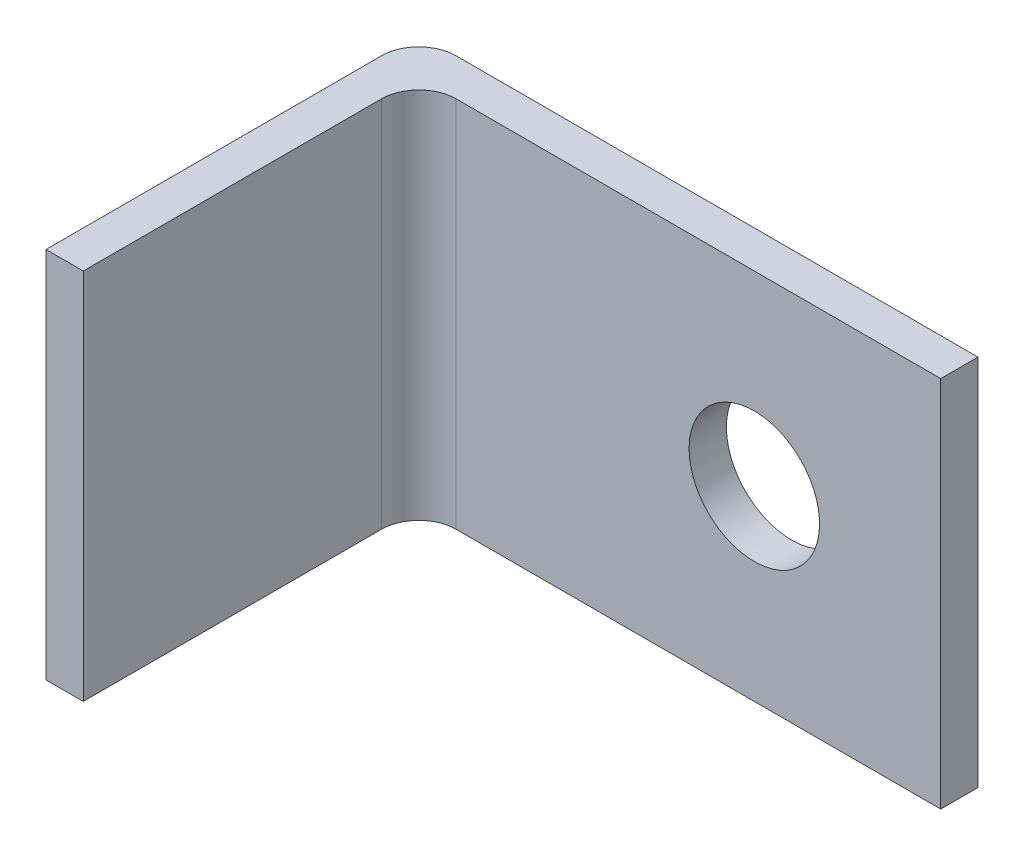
ISO-10303-21;
HEADER;
FILE_DESCRIPTION(('STEP AP214'),'2;1');
FILE_NAME('part.step','',(''),(''),'','','');
FILE_SCHEMA(('AUTOMOTIVE_DESIGN { 1 0 10303 214 1 1 1 1 }'));
ENDSEC;
DATA;
#1=APPLICATION_CONTEXT('core data for automotive mechanical design processes');
#2=APPLICATION_PROTOCOL_DEFINITION('international standard','automotive_design',2000,#1);
#3=PRODUCT_CONTEXT('',#1,'mechanical');
#4=PRODUCT('Part','Part','',(#3));
#5=PRODUCT_RELATED_PRODUCT_CATEGORY('part','',(#4));
#6=PRODUCT_DEFINITION_FORMATION('','',#4);
#7=PRODUCT_DEFINITION_CONTEXT('part definition',#1,'design');
#8=PRODUCT_DEFINITION('design','',#6,#7);
#9=PRODUCT_DEFINITION_SHAPE('','',#8);
#10=(LENGTH_UNIT() NAMED_UNIT(*) SI_UNIT(.MILLI.,.METRE.));
#11=(NAMED_UNIT(*) PLANE_ANGLE_UNIT() SI_UNIT($,.RADIAN.));
#12=(NAMED_UNIT(*) SI_UNIT($,.STERADIAN.) SOLID_ANGLE_UNIT());
#13=UNCERTAINTY_MEASURE_WITH_UNIT(LENGTH_MEASURE(1.E-05),#10,'distance_accuracy_value','');
#14=(GEOMETRIC_REPRESENTATION_CONTEXT(3) GLOBAL_UNCERTAINTY_ASSIGNED_CONTEXT((#13)) GLOBAL_UNIT_ASSIGNED_CONTEXT((#10,
#11,#12)) REPRESENTATION_CONTEXT('',''));
#15=CARTESIAN_POINT('',(0.,0.,0.));
#16=DIRECTION('',(0.,0.,1.));
#17=DIRECTION('',(1.,0.,0.));
#18=AXIS2_PLACEMENT_3D('',#15,#16,#17);
#19=CARTESIAN_POINT('',(1.,10.,0.));
#20=DIRECTION('',(0.,0.,-1.));
#21=DIRECTION('',(-1.,0.,0.));
#22=AXIS2_PLACEMENT_3D('',#19,#20,#21);
#23=PLANE('',#22);
#24=DIRECTION('',(1.,0.,0.));
#25=VECTOR('',#24,1.);
#26=CARTESIAN_POINT('',(1.,0.,0.));
#27=LINE('',#26,#25);
#28=CARTESIAN_POINT('',(0.,0.,0.));
#29=VERTEX_POINT('',#28);
#30=CARTESIAN_POINT('',(1.,0.,0.));
#31=VERTEX_POINT('',#30);
#32=EDGE_CURVE('E99',#29,#31,#27,.T.);
#33=ORIENTED_EDGE('',*,*,#32,.T.);
#34=DIRECTION('',(0.,-1.,0.));
#35=VECTOR('',#34,1.);
#36=CARTESIAN_POINT('',(1.,10.,0.));
#37=LINE('',#36,#35);
#38=CARTESIAN_POINT('',(1.,10.,0.));
#39=VERTEX_POINT('',#38);
#40=EDGE_CURVE('E103',#39,#31,#37,.T.);
#41=ORIENTED_EDGE('',*,*,#40,.F.);
#42=DIRECTION('',(1.,0.,0.));
#43=VECTOR('',#42,1.);
#44=CARTESIAN_POINT('',(1.,10.,0.));
#45=LINE('',#44,#43);
#46=CARTESIAN_POINT('',(0.,10.,0.));
#47=VERTEX_POINT('',#46);
#48=EDGE_CURVE('E130',#47,#39,#45,.T.);
#49=ORIENTED_EDGE('',*,*,#48,.F.);
#50=DIRECTION('',(0.,-1.,0.));
#51=VECTOR('',#50,1.);
#52=CARTESIAN_POINT('',(0.,10.,0.));
#53=LINE('',#52,#51);
#54=EDGE_CURVE('E114',#47,#29,#53,.T.);
#55=ORIENTED_EDGE('',*,*,#54,.T.);
#56=EDGE_LOOP('',(#33,#41,#49,#55));
#57=FACE_BOUND('',#56,.T.);
#58=ADVANCED_FACE('F34',(#57),#23,.F.);
#59=CARTESIAN_POINT('',(1.,10.,0.));
#60=DIRECTION('',(-1.,0.,0.));
#61=DIRECTION('',(0.,0.,1.));
#62=AXIS2_PLACEMENT_3D('',#59,#60,#61);
#63=PLANE('',#62);
#64=DIRECTION('',(0.,0.,-1.));
#65=VECTOR('',#64,1.);
#66=CARTESIAN_POINT('',(1.,0.,0.));
#67=LINE('',#66,#65);
#68=CARTESIAN_POINT('',(1.,0.,-8.));
#69=VERTEX_POINT('',#68);
#70=EDGE_CURVE('E94',#31,#69,#67,.T.);
#71=ORIENTED_EDGE('',*,*,#70,.T.);
#72=DIRECTION('',(0.,-1.,0.));
#73=VECTOR('',#72,1.);
#74=CARTESIAN_POINT('',(1.,10.,-8.));
#75=LINE('',#74,#73);
#76=CARTESIAN_POINT('',(1.,10.,-8.));
#77=VERTEX_POINT('',#76);
#78=EDGE_CURVE('E48',#69,#77,#75,.F.);
#79=ORIENTED_EDGE('',*,*,#78,.T.);
#80=DIRECTION('',(0.,0.,-1.));
#81=VECTOR('',#80,1.);
#82=CARTESIAN_POINT('',(1.,10.,0.));
#83=LINE('',#82,#81);
#84=EDGE_CURVE('E105',#39,#77,#83,.T.);
#85=ORIENTED_EDGE('',*,*,#84,.F.);
#86=ORIENTED_EDGE('',*,*,#40,.T.);
#87=EDGE_LOOP('',(#71,#79,#85,#86));
#88=FACE_BOUND('',#87,.T.);
#89=ADVANCED_FACE('F104',(#88),#63,.F.);
#90=CARTESIAN_POINT('',(1.,10.,-9.));
#91=DIRECTION('',(0.,0.,-1.));
#92=DIRECTION('',(-1.,0.,0.));
#93=AXIS2_PLACEMENT_3D('',#90,#91,#92);
#94=PLANE('',#93);
#95=CARTESIAN_POINT('',(10.,5.,-9.));
#96=DIRECTION('',(0.,0.,-1.));
#97=DIRECTION('',(-1.,0.,0.));
#98=AXIS2_PLACEMENT_3D('',#95,#96,#97);
#99=CIRCLE('',#98,1.75);
#100=CARTESIAN_POINT('',(8.25,5.,-9.));
#101=VERTEX_POINT('',#100);
#102=EDGE_CURVE('E115',#101,#101,#99,.T.);
#103=ORIENTED_EDGE('',*,*,#102,.T.);
#104=EDGE_LOOP('',(#103));
#105=FACE_BOUND('',#104,.T.);
#106=DIRECTION('',(1.,0.,0.));
#107=VECTOR('',#106,1.);
#108=CARTESIAN_POINT('',(1.,10.,-9.));
#109=LINE('',#108,#107);
#110=CARTESIAN_POINT('',(2.,10.,-9.));
#111=VERTEX_POINT('',#110);
#112=CARTESIAN_POINT('',(15.,10.,-9.));
#113=VERTEX_POINT('',#112);
#114=EDGE_CURVE('E133',#111,#113,#109,.T.);
#115=ORIENTED_EDGE('',*,*,#114,.F.);
#116=DIRECTION('',(0.,-1.,0.));
#117=VECTOR('',#116,1.);
#118=CARTESIAN_POINT('',(2.,0.,-9.));
#119=LINE('',#118,#117);
#120=CARTESIAN_POINT('',(2.,0.,-9.));
#121=VERTEX_POINT('',#120);
#122=EDGE_CURVE('E156',#111,#121,#119,.T.);
#123=ORIENTED_EDGE('',*,*,#122,.T.);
#124=DIRECTION('',(1.,0.,0.));
#125=VECTOR('',#124,1.);
#126=CARTESIAN_POINT('',(1.,0.,-9.));
#127=LINE('',#126,#125);
#128=CARTESIAN_POINT('',(15.,0.,-9.));
#129=VERTEX_POINT('',#128);
#130=EDGE_CURVE('E100',#121,#129,#127,.T.);
#131=ORIENTED_EDGE('',*,*,#130,.T.);
#132=DIRECTION('',(0.,-1.,0.));
#133=VECTOR('',#132,1.);
#134=CARTESIAN_POINT('',(15.,10.,-9.));
#135=LINE('',#134,#133);
#136=EDGE_CURVE('E110',#113,#129,#135,.T.);
#137=ORIENTED_EDGE('',*,*,#136,.F.);
#138=EDGE_LOOP('',(#115,#123,#131,#137));
#139=FACE_BOUND('',#138,.T.);
#140=ADVANCED_FACE('F162',(#105,#139),#94,.F.);
#141=CARTESIAN_POINT('',(15.,10.,-10.));
#142=DIRECTION('',(-1.,0.,0.));
#143=DIRECTION('',(0.,0.,1.));
#144=AXIS2_PLACEMENT_3D('',#141,#142,#143);
#145=PLANE('',#144);
#146=DIRECTION('',(0.,0.,-1.));
#147=VECTOR('',#146,1.);
#148=CARTESIAN_POINT('',(15.,0.,-10.));
#149=LINE('',#148,#147);
#150=CARTESIAN_POINT('',(15.,0.,-10.));
#151=VERTEX_POINT('',#150);
#152=EDGE_CURVE('E123',#129,#151,#149,.T.);
#153=ORIENTED_EDGE('',*,*,#152,.T.);
#154=DIRECTION('',(0.,-1.,0.));
#155=VECTOR('',#154,1.);
#156=CARTESIAN_POINT('',(15.,10.,-10.));
#157=LINE('',#156,#155);
#158=CARTESIAN_POINT('',(15.,10.,-10.));
#159=VERTEX_POINT('',#158);
#160=EDGE_CURVE('E143',#159,#151,#157,.T.);
#161=ORIENTED_EDGE('',*,*,#160,.F.);
#162=DIRECTION('',(0.,0.,-1.));
#163=VECTOR('',#162,1.);
#164=CARTESIAN_POINT('',(15.,10.,-10.));
#165=LINE('',#164,#163);
#166=EDGE_CURVE('E135',#113,#159,#165,.T.);
#167=ORIENTED_EDGE('',*,*,#166,.F.);
#168=ORIENTED_EDGE('',*,*,#136,.T.);
#169=EDGE_LOOP('',(#153,#161,#167,#168));
#170=FACE_BOUND('',#169,.T.);
#171=ADVANCED_FACE('F170',(#170),#145,.F.);
#172=CARTESIAN_POINT('',(0.,10.,-10.));
#173=DIRECTION('',(0.,0.,1.));
#174=DIRECTION('',(1.,0.,0.));
#175=AXIS2_PLACEMENT_3D('',#172,#173,#174);
#176=PLANE('',#175);
#177=CARTESIAN_POINT('',(10.,5.,-10.));
#178=DIRECTION('',(0.,0.,-1.));
#179=DIRECTION('',(-1.,0.,0.));
#180=AXIS2_PLACEMENT_3D('',#177,#178,#179);
#181=CIRCLE('',#180,1.75);
#182=CARTESIAN_POINT('',(8.25,5.,-10.));
#183=VERTEX_POINT('',#182);
#184=EDGE_CURVE('E118',#183,#183,#181,.T.);
#185=ORIENTED_EDGE('',*,*,#184,.F.);
#186=EDGE_LOOP('',(#185));
#187=FACE_BOUND('',#186,.T.);
#188=DIRECTION('',(-1.,0.,0.));
#189=VECTOR('',#188,1.);
#190=CARTESIAN_POINT('',(0.,0.,-10.));
#191=LINE('',#190,#189);
#192=CARTESIAN_POINT('',(1.,0.,-10.));
#193=VERTEX_POINT('',#192);
#194=EDGE_CURVE('E125',#151,#193,#191,.T.);
#195=ORIENTED_EDGE('',*,*,#194,.T.);
#196=DIRECTION('',(0.,-1.,0.));
#197=VECTOR('',#196,1.);
#198=CARTESIAN_POINT('',(1.,10.,-10.));
#199=LINE('',#198,#197);
#200=CARTESIAN_POINT('',(1.,10.,-10.));
#201=VERTEX_POINT('',#200);
#202=EDGE_CURVE('E152',#193,#201,#199,.F.);
#203=ORIENTED_EDGE('',*,*,#202,.T.);
#204=DIRECTION('',(-1.,0.,0.));
#205=VECTOR('',#204,1.);
#206=CARTESIAN_POINT('',(0.,10.,-10.));
#207=LINE('',#206,#205);
#208=EDGE_CURVE('E137',#159,#201,#207,.T.);
#209=ORIENTED_EDGE('',*,*,#208,.F.);
#210=ORIENTED_EDGE('',*,*,#160,.T.);
#211=EDGE_LOOP('',(#195,#203,#209,#210));
#212=FACE_BOUND('',#211,.T.);
#213=ADVANCED_FACE('F174',(#187,#212),#176,.F.);
#214=CARTESIAN_POINT('',(0.,10.,0.));
#215=DIRECTION('',(1.,0.,0.));
#216=DIRECTION('',(0.,0.,-1.));
#217=AXIS2_PLACEMENT_3D('',#214,#215,#216);
#218=PLANE('',#217);
#219=DIRECTION('',(0.,0.,1.));
#220=VECTOR('',#219,1.);
#221=CARTESIAN_POINT('',(0.,10.,0.));
#222=LINE('',#221,#220);
#223=CARTESIAN_POINT('',(0.,10.,-9.));
#224=VERTEX_POINT('',#223);
#225=EDGE_CURVE('E140',#224,#47,#222,.T.);
#226=ORIENTED_EDGE('',*,*,#225,.F.);
#227=DIRECTION('',(0.,-1.,0.));
#228=VECTOR('',#227,1.);
#229=CARTESIAN_POINT('',(0.,10.,-9.));
#230=LINE('',#229,#228);
#231=CARTESIAN_POINT('',(0.,0.,-9.));
#232=VERTEX_POINT('',#231);
#233=EDGE_CURVE('E109',#224,#232,#230,.T.);
#234=ORIENTED_EDGE('',*,*,#233,.T.);
#235=DIRECTION('',(0.,0.,1.));
#236=VECTOR('',#235,1.);
#237=CARTESIAN_POINT('',(0.,0.,0.));
#238=LINE('',#237,#236);
#239=EDGE_CURVE('E128',#232,#29,#238,.T.);
#240=ORIENTED_EDGE('',*,*,#239,.T.);
#241=ORIENTED_EDGE('',*,*,#54,.F.);
#242=EDGE_LOOP('',(#226,#234,#240,#241));
#243=FACE_BOUND('',#242,.T.);
#244=ADVANCED_FACE('F184',(#243),#218,.F.);
#245=CARTESIAN_POINT('',(0.,10.,0.));
#246=DIRECTION('',(0.,-1.,0.));
#247=DIRECTION('',(0.,0.,-1.));
#248=AXIS2_PLACEMENT_3D('',#245,#246,#247);
#249=PLANE('',#248);
#250=ORIENTED_EDGE('',*,*,#208,.T.);
#251=CARTESIAN_POINT('',(1.,10.,-9.));
#252=DIRECTION('',(0.,-1.,0.));
#253=DIRECTION('',(0.,0.,-1.));
#254=AXIS2_PLACEMENT_3D('',#251,#252,#253);
#255=CIRCLE('',#254,1.);
#256=EDGE_CURVE('E154',#201,#224,#255,.F.);
#257=ORIENTED_EDGE('',*,*,#256,.T.);
#258=ORIENTED_EDGE('',*,*,#225,.T.);
#259=ORIENTED_EDGE('',*,*,#48,.T.);
#260=ORIENTED_EDGE('',*,*,#84,.T.);
#261=CARTESIAN_POINT('',(2.,10.,-8.));
#262=DIRECTION('',(0.,-1.,0.));
#263=DIRECTION('',(0.,0.,-1.));
#264=AXIS2_PLACEMENT_3D('',#261,#262,#263);
#265=CIRCLE('',#264,1.);
#266=EDGE_CURVE('E11',#77,#111,#265,.T.);
#267=ORIENTED_EDGE('',*,*,#266,.T.);
#268=ORIENTED_EDGE('',*,*,#114,.T.);
#269=ORIENTED_EDGE('',*,*,#166,.T.);
#270=EDGE_LOOP('',(#250,#257,#258,#259,#260,#267,#268,#269));
#271=FACE_BOUND('',#270,.T.);
#272=ADVANCED_FACE('F178',(#271),#249,.F.);
#273=CARTESIAN_POINT('',(0.,0.,0.));
#274=DIRECTION('',(0.,-1.,0.));
#275=DIRECTION('',(0.,0.,-1.));
#276=AXIS2_PLACEMENT_3D('',#273,#274,#275);
#277=PLANE('',#276);
#278=ORIENTED_EDGE('',*,*,#239,.F.);
#279=CARTESIAN_POINT('',(1.,0.,-9.));
#280=DIRECTION('',(0.,-1.,0.));
#281=DIRECTION('',(0.,0.,-1.));
#282=AXIS2_PLACEMENT_3D('',#279,#280,#281);
#283=CIRCLE('',#282,1.);
#284=EDGE_CURVE('E150',#232,#193,#283,.T.);
#285=ORIENTED_EDGE('',*,*,#284,.T.);
#286=ORIENTED_EDGE('',*,*,#194,.F.);
#287=ORIENTED_EDGE('',*,*,#152,.F.);
#288=ORIENTED_EDGE('',*,*,#130,.F.);
#289=CARTESIAN_POINT('',(2.,0.,-8.));
#290=DIRECTION('',(0.,-1.,0.));
#291=DIRECTION('',(0.,0.,-1.));
#292=AXIS2_PLACEMENT_3D('',#289,#290,#291);
#293=CIRCLE('',#292,1.);
#294=EDGE_CURVE('E41',#121,#69,#293,.F.);
#295=ORIENTED_EDGE('',*,*,#294,.T.);
#296=ORIENTED_EDGE('',*,*,#70,.F.);
#297=ORIENTED_EDGE('',*,*,#32,.F.);
#298=EDGE_LOOP('',(#278,#285,#286,#287,#288,#295,#296,#297));
#299=FACE_BOUND('',#298,.T.);
#300=ADVANCED_FACE('F97',(#299),#277,.T.);
#301=CARTESIAN_POINT('',(10.,5.,0.));
#302=DIRECTION('',(0.,0.,-1.));
#303=DIRECTION('',(-1.,0.,0.));
#304=AXIS2_PLACEMENT_3D('',#301,#302,#303);
#305=CYLINDRICAL_SURFACE('',#304,1.75);
#306=ORIENTED_EDGE('',*,*,#184,.T.);
#307=EDGE_LOOP('',(#306));
#308=FACE_BOUND('',#307,.T.);
#309=ORIENTED_EDGE('',*,*,#102,.F.);
#310=EDGE_LOOP('',(#309));
#311=FACE_BOUND('',#310,.T.);
#312=ADVANCED_FACE('F191',(#308,#311),#305,.F.);
#313=CARTESIAN_POINT('',(1.,10.,-9.));
#314=DIRECTION('',(0.,-1.,0.));
#315=DIRECTION('',(0.,0.,-1.));
#316=AXIS2_PLACEMENT_3D('',#313,#314,#315);
#317=CYLINDRICAL_SURFACE('',#316,1.);
#318=ORIENTED_EDGE('',*,*,#256,.F.);
#319=ORIENTED_EDGE('',*,*,#202,.F.);
#320=ORIENTED_EDGE('',*,*,#284,.F.);
#321=ORIENTED_EDGE('',*,*,#233,.F.);
#322=EDGE_LOOP('',(#318,#319,#320,#321));
#323=FACE_BOUND('',#322,.T.);
#324=ADVANCED_FACE('F182',(#323),#317,.T.);
#325=CARTESIAN_POINT('',(2.,10.,-8.));
#326=DIRECTION('',(0.,1.,0.));
#327=DIRECTION('',(0.,0.,1.));
#328=AXIS2_PLACEMENT_3D('',#325,#326,#327);
#329=CYLINDRICAL_SURFACE('',#328,1.);
#330=ORIENTED_EDGE('',*,*,#266,.F.);
#331=ORIENTED_EDGE('',*,*,#78,.F.);
#332=ORIENTED_EDGE('',*,*,#294,.F.);
#333=ORIENTED_EDGE('',*,*,#122,.F.);
#334=EDGE_LOOP('',(#330,#331,#332,#333));
#335=FACE_BOUND('',#334,.T.);
#336=ADVANCED_FACE('F185',(#335),#329,.F.);
#337=CLOSED_SHELL('',(#58,#89,#140,#171,#213,#244,#272,#300,#312,#324,#336));
#338=MANIFOLD_SOLID_BREP('B2',#337);
#339=ADVANCED_BREP_SHAPE_REPRESENTATION('',(#18,#338),#14);
#340=SHAPE_DEFINITION_REPRESENTATION(#9,#339);
ENDSEC;
END-ISO-10303-21;
